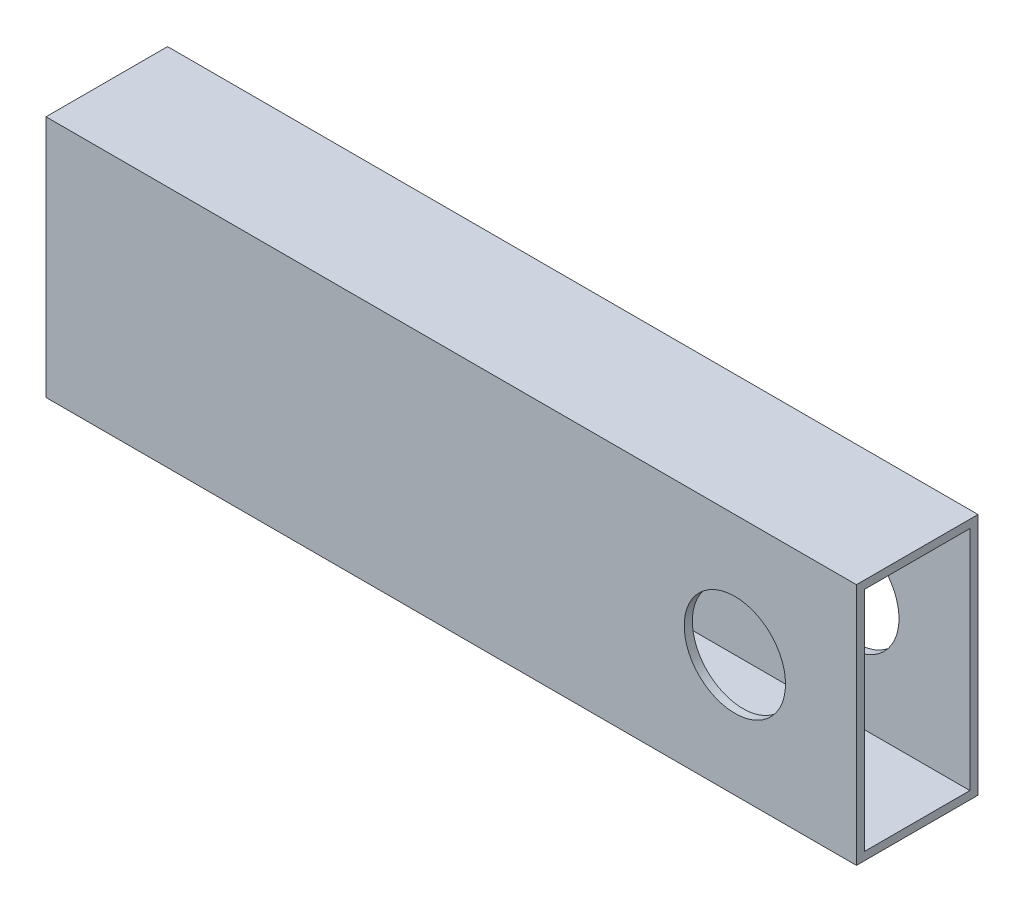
from build123d import *

# Parameters (mm, degrees)
ESQUISSE1_W             = 200
ESQUISSE1_H             = 60
ESQUISSE1_R             = 12.5
EXTRUSION1_DEPTH        = 30
ESQUISSE2_W             = 26
ESQUISSE2_H             = 56
ENL_V_MAT_EXTRU_1_DEPTH = 211.950231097


with BuildPart() as part:
    # Esquisse1 → Extrusion1 (new body)
    with BuildSketch(Plane.XY):
        with Locations((100, 30)):
            Rectangle(ESQUISSE1_W, ESQUISSE1_H)
        with Locations((170, 30)):
            Circle(ESQUISSE1_R, mode=Mode.SUBTRACT)
    extrude(amount=EXTRUSION1_DEPTH)

    # Esquisse2 → Enl_v. mat.-Extru.1 (cut, through all)
    with BuildSketch(Plane(origin=(200, 0, 0), x_dir=(0, 0, -1), z_dir=(1, 0, 0))):
        with Locations((-15, 30)):
            Rectangle(ESQUISSE2_W, ESQUISSE2_H)
    extrude(amount=-ENL_V_MAT_EXTRU_1_DEPTH, mode=Mode.SUBTRACT)


solid = part.part
